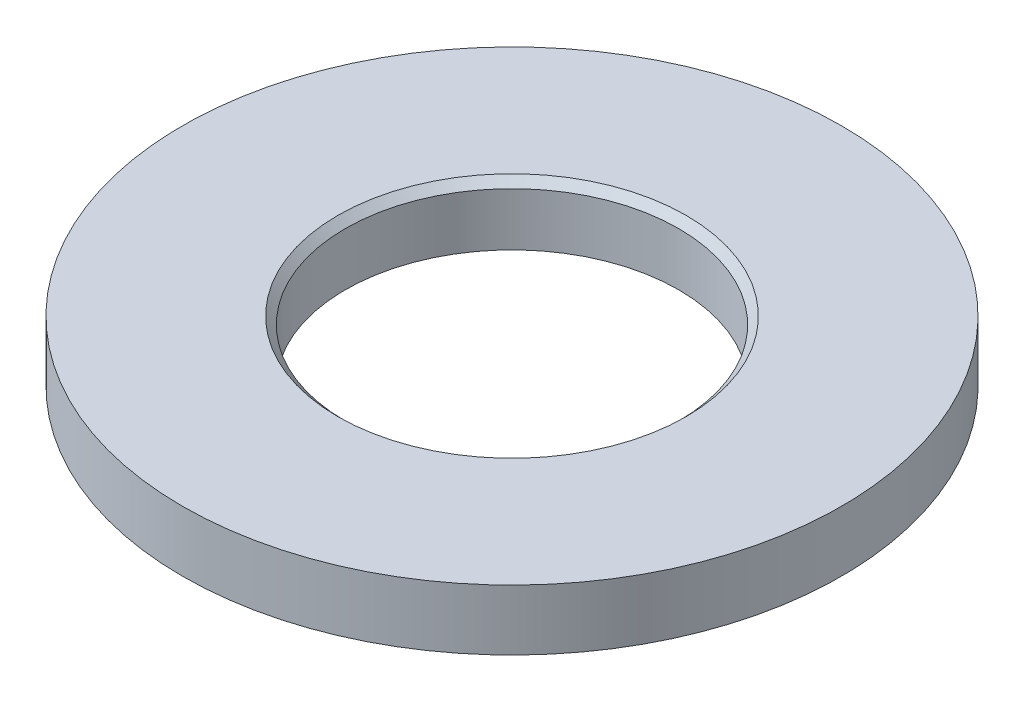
from build123d import *

# Parameters (mm, degrees)
SKETCH1_R      = 4.35
SKETCH1_R_2    = 2.2
EXTRUDE1_DEPTH = 0.8
CHAMFER1_SIZE  = 0.1


with BuildPart() as part:
    # Sketch1 → Extrude1 (new body)
    with BuildSketch(Plane(origin=(0, 0, 0), x_dir=(1, 0, 0), z_dir=(0, 1, 0))):
        with Locations(Location((0, 0, 0), (0, 0, 90))):
            Circle(SKETCH1_R)
        with Locations(Location((0, 0, 0), (0, 0, 90))):
            Circle(SKETCH1_R_2, mode=Mode.SUBTRACT)
    extrude(amount=EXTRUDE1_DEPTH)

    # Chamfer1
    chamfer1_edges = [part.edges().sort_by_distance(p)[0] for p in [
        (0, 0.8, 2.2),
    ]]
    chamfer(chamfer1_edges, length=CHAMFER1_SIZE)


solid = part.part
